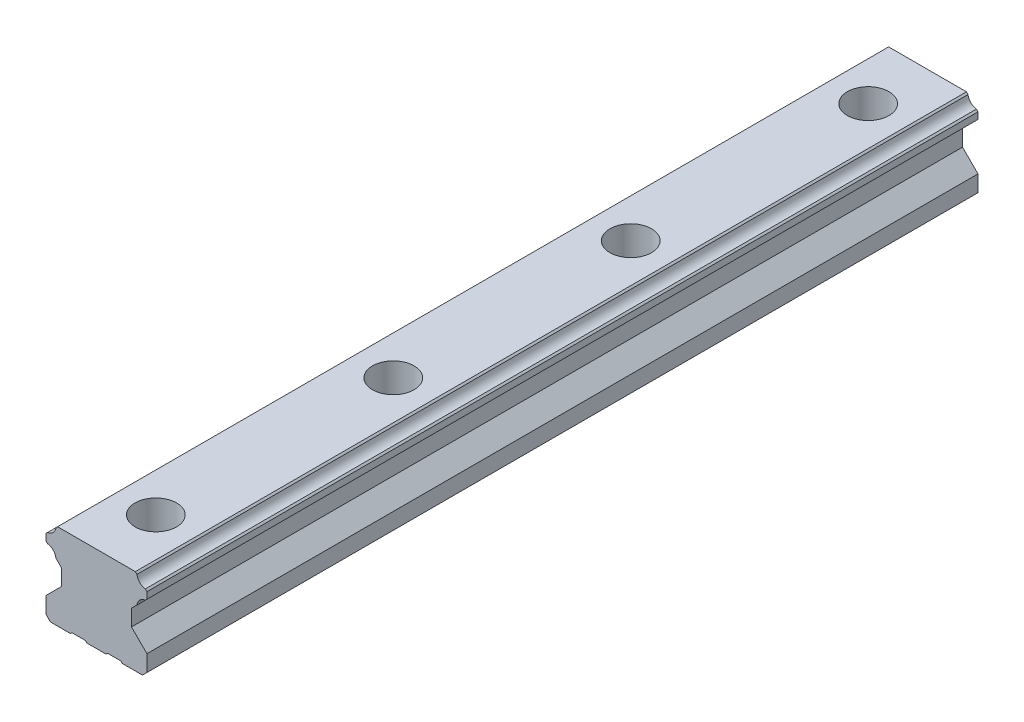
from build123d import *

# Parameters (mm, degrees)
BOSS_EXTRUDE1_DEPTH                                 = 140
CBORE_FOR_M4_HEX_SOCKET_HEAD_CAP_SCREW1_D           = 9
CBORE_FOR_M4_HEX_SOCKET_HEAD_CAP_SCREW1_CBORE_D     = 14
CBORE_FOR_M4_HEX_SOCKET_HEAD_CAP_SCREW1_CBORE_DEPTH = 12
LPATTERN1_COUNT                                     = 4
LPATTERN1_PITCH                                     = 80


with BuildPart() as part:
    # Sketch1 → Boss-Extrude1 (new, symmetric)
    with BuildSketch(Plane.XY):
        with BuildLine():
            Line((-13.639828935, 28.470329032), (-13.110158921, 29))
            Line((-13.110158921, 29), (13.110158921, 29))
            Line((13.110158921, 29), (13.639828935, 28.470329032))
            ThreePointArc((13.639828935, 28.470329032), (14.576704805, 26.578413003), (16.46862115, 25.641537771))
            Line((16.46862115, 25.641537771), (17, 25.11015892))
            Line((17, 25.11015892), (17, 22.879291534))
            Line((17, 22.879291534), (16.481633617, 22.360925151))
            ThreePointArc((16.481633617, 22.360925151), (14.576704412, 21.422319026), (13.638098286, 19.517389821))
            Line((13.638098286, 19.517389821), (11.800292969, 17.679584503))
            Line((11.800292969, 17.679584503), (11.80028839, 12.199883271))
            Line((11.80028839, 12.199883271), (17, 7.000171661))
            Line((17, 7.000171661), (17, 1.5))
            Line((17, 1.5), (15.5, 0))
            Line((15.5, 0), (8.745, 0))
            Line((8.745, 0), (8.245, 0.5))
            Line((8.245, 0.5), (3.75, 0.5))
            Line((3.75, 0.5), (3.25, 0))
            Line((3.25, 0), (-3.25, 0))
            Line((-3.25, 0), (-3.75, 0.5))
            Line((-3.75, 0.5), (-8.245, 0.5))
            Line((-8.245, 0.5), (-8.745, 0))
            Line((-8.745, 0), (-15.5, 0))
            Line((-15.5, 0), (-17, 1.5))
            Line((-17, 1.5), (-17, 7.000171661))
            Line((-17, 7.000171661), (-11.80028839, 12.199883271))
            Line((-11.80028839, 12.199883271), (-11.800292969, 17.679584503))
            Line((-11.800292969, 17.679584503), (-13.638098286, 19.517389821))
            ThreePointArc((-13.638098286, 19.517389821), (-14.576704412, 21.422319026), (-16.481633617, 22.360925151))
            Line((-16.481633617, 22.360925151), (-17, 22.879291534))
            Line((-17, 22.879291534), (-17, 25.11015892))
            Line((-17, 25.11015892), (-16.46862115, 25.641537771))
            ThreePointArc((-16.46862115, 25.641537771), (-14.576704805, 26.578413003), (-13.639828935, 28.470329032))
        make_face()
    extrude(amount=BOSS_EXTRUDE1_DEPTH, both=True)

    # CBORE for M4 Hex Socket Head Cap Screw1 (through all)
    with Locations(Plane(origin=(0, 29, 0), x_dir=(1, 0, 0), z_dir=(0, 1, 0))):
        with Locations((0, -120)):
            cbore_for_m4_hex_socket_head_cap_screw1 = CounterBoreHole(CBORE_FOR_M4_HEX_SOCKET_HEAD_CAP_SCREW1_D / 2, CBORE_FOR_M4_HEX_SOCKET_HEAD_CAP_SCREW1_CBORE_D / 2, CBORE_FOR_M4_HEX_SOCKET_HEAD_CAP_SCREW1_CBORE_DEPTH)

    # LPattern1: CBORE for M4 Hex Socket Head Cap Screw1 ×4
    with Locations(*[(0, 0, -i * LPATTERN1_PITCH) for i in range(1, LPATTERN1_COUNT)]):
        add(cbore_for_m4_hex_socket_head_cap_screw1, mode=Mode.SUBTRACT)


solid = part.part
